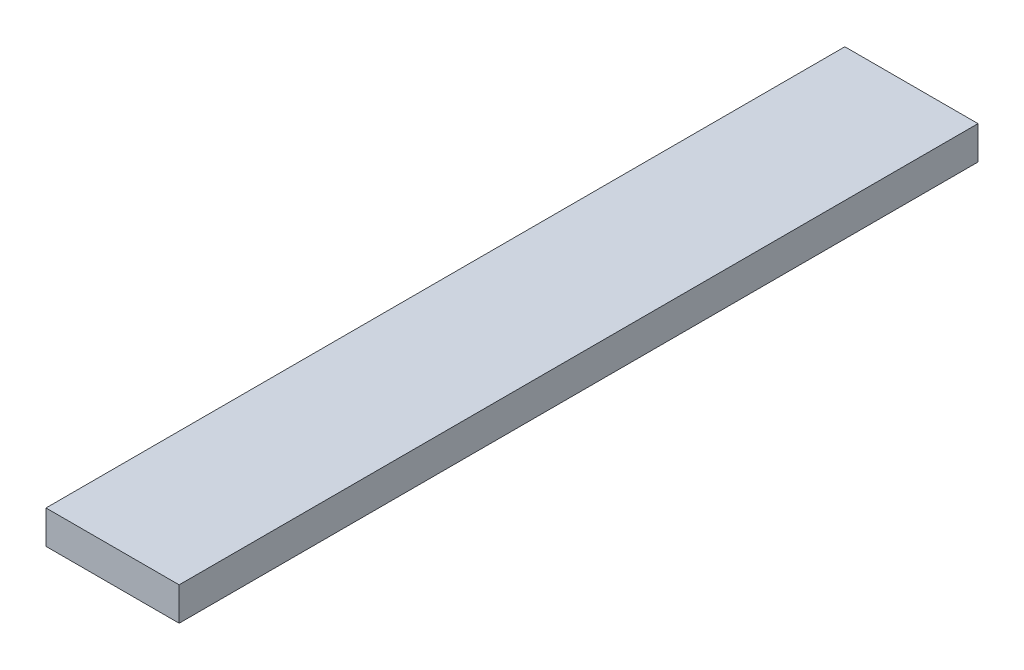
ISO-10303-21;
HEADER;
FILE_DESCRIPTION(('STEP AP214'),'2;1');
FILE_NAME('part.step','',(''),(''),'','','');
FILE_SCHEMA(('AUTOMOTIVE_DESIGN { 1 0 10303 214 1 1 1 1 }'));
ENDSEC;
DATA;
#1=APPLICATION_CONTEXT('core data for automotive mechanical design processes');
#2=APPLICATION_PROTOCOL_DEFINITION('international standard','automotive_design',2000,#1);
#3=PRODUCT_CONTEXT('',#1,'mechanical');
#4=PRODUCT('Part','Part','',(#3));
#5=PRODUCT_RELATED_PRODUCT_CATEGORY('part','',(#4));
#6=PRODUCT_DEFINITION_FORMATION('','',#4);
#7=PRODUCT_DEFINITION_CONTEXT('part definition',#1,'design');
#8=PRODUCT_DEFINITION('design','',#6,#7);
#9=PRODUCT_DEFINITION_SHAPE('','',#8);
#10=(LENGTH_UNIT() NAMED_UNIT(*) SI_UNIT(.MILLI.,.METRE.));
#11=(NAMED_UNIT(*) PLANE_ANGLE_UNIT() SI_UNIT($,.RADIAN.));
#12=(NAMED_UNIT(*) SI_UNIT($,.STERADIAN.) SOLID_ANGLE_UNIT());
#13=UNCERTAINTY_MEASURE_WITH_UNIT(LENGTH_MEASURE(1.E-05),#10,'distance_accuracy_value','');
#14=(GEOMETRIC_REPRESENTATION_CONTEXT(3) GLOBAL_UNCERTAINTY_ASSIGNED_CONTEXT((#13)) GLOBAL_UNIT_ASSIGNED_CONTEXT((#10,
#11,#12)) REPRESENTATION_CONTEXT('',''));
#15=CARTESIAN_POINT('',(0.,0.,0.));
#16=DIRECTION('',(0.,0.,1.));
#17=DIRECTION('',(1.,0.,0.));
#18=AXIS2_PLACEMENT_3D('',#15,#16,#17);
#19=CARTESIAN_POINT('',(1.32949207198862E-11,3.88578058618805E-13,120.000000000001));
#20=DIRECTION('',(1.,0.,0.));
#21=DIRECTION('',(0.,0.,-1.));
#22=AXIS2_PLACEMENT_3D('',#19,#20,#21);
#23=PLANE('',#22);
#24=DIRECTION('',(0.,-1.,0.));
#25=VECTOR('',#24,1.);
#26=CARTESIAN_POINT('',(0.,0.,0.));
#27=LINE('',#26,#25);
#28=CARTESIAN_POINT('',(-4.44089209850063E-13,5.00000000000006,-3.33066907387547E-13));
#29=VERTEX_POINT('',#28);
#30=CARTESIAN_POINT('',(0.,0.,0.));
#31=VERTEX_POINT('',#30);
#32=EDGE_CURVE('E81',#29,#31,#27,.T.);
#33=ORIENTED_EDGE('',*,*,#32,.T.);
#34=DIRECTION('',(0.,0.,-1.));
#35=VECTOR('',#34,1.);
#36=CARTESIAN_POINT('',(1.32949207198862E-11,3.88578058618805E-13,120.000000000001));
#37=LINE('',#36,#35);
#38=CARTESIAN_POINT('',(1.32949207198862E-11,3.88578058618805E-13,120.000000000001));
#39=VERTEX_POINT('',#38);
#40=EDGE_CURVE('E11',#39,#31,#37,.T.);
#41=ORIENTED_EDGE('',*,*,#40,.F.);
#42=DIRECTION('',(0.,-1.,0.));
#43=VECTOR('',#42,1.);
#44=CARTESIAN_POINT('',(1.32949207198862E-11,3.88578058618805E-13,120.000000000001));
#45=LINE('',#44,#43);
#46=CARTESIAN_POINT('',(1.30728761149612E-11,5.00000000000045,120.000000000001));
#47=VERTEX_POINT('',#46);
#48=EDGE_CURVE('E104',#47,#39,#45,.T.);
#49=ORIENTED_EDGE('',*,*,#48,.F.);
#50=DIRECTION('',(0.,0.,-1.));
#51=VECTOR('',#50,1.);
#52=CARTESIAN_POINT('',(1.30728761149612E-11,5.00000000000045,120.000000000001));
#53=LINE('',#52,#51);
#54=EDGE_CURVE('E94',#47,#29,#53,.T.);
#55=ORIENTED_EDGE('',*,*,#54,.T.);
#56=EDGE_LOOP('',(#33,#41,#49,#55));
#57=FACE_BOUND('',#56,.T.);
#58=ADVANCED_FACE('F36',(#57),#23,.F.);
#59=CARTESIAN_POINT('',(1.32949207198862E-11,3.88578058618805E-13,120.000000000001));
#60=DIRECTION('',(0.,1.,0.));
#61=DIRECTION('',(0.,0.,1.));
#62=AXIS2_PLACEMENT_3D('',#59,#60,#61);
#63=PLANE('',#62);
#64=DIRECTION('',(1.,0.,0.));
#65=VECTOR('',#64,1.);
#66=CARTESIAN_POINT('',(0.,0.,0.));
#67=LINE('',#66,#65);
#68=CARTESIAN_POINT('',(20.,-7.7715611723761E-13,1.11022302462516E-13));
#69=VERTEX_POINT('',#68);
#70=EDGE_CURVE('E77',#31,#69,#67,.T.);
#71=ORIENTED_EDGE('',*,*,#70,.T.);
#72=DIRECTION('',(0.,0.,-1.));
#73=VECTOR('',#72,1.);
#74=CARTESIAN_POINT('',(20.0000000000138,-3.88578058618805E-13,120.));
#75=LINE('',#74,#73);
#76=CARTESIAN_POINT('',(20.0000000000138,-3.88578058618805E-13,120.));
#77=VERTEX_POINT('',#76);
#78=EDGE_CURVE('E44',#77,#69,#75,.T.);
#79=ORIENTED_EDGE('',*,*,#78,.F.);
#80=DIRECTION('',(1.,0.,0.));
#81=VECTOR('',#80,1.);
#82=CARTESIAN_POINT('',(1.32949207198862E-11,3.88578058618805E-13,120.000000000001));
#83=LINE('',#82,#81);
#84=EDGE_CURVE('E90',#39,#77,#83,.T.);
#85=ORIENTED_EDGE('',*,*,#84,.F.);
#86=ORIENTED_EDGE('',*,*,#40,.T.);
#87=EDGE_LOOP('',(#71,#79,#85,#86));
#88=FACE_BOUND('',#87,.T.);
#89=ADVANCED_FACE('F89',(#88),#63,.F.);
#90=CARTESIAN_POINT('',(20.0000000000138,-3.88578058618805E-13,120.));
#91=DIRECTION('',(-1.,0.,0.));
#92=DIRECTION('',(0.,0.,1.));
#93=AXIS2_PLACEMENT_3D('',#90,#91,#92);
#94=PLANE('',#93);
#95=DIRECTION('',(0.,1.,0.));
#96=VECTOR('',#95,1.);
#97=CARTESIAN_POINT('',(20.,-7.7715611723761E-13,1.11022302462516E-13));
#98=LINE('',#97,#96);
#99=CARTESIAN_POINT('',(20.0000000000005,4.99999999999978,0.));
#100=VERTEX_POINT('',#99);
#101=EDGE_CURVE('E82',#69,#100,#98,.T.);
#102=ORIENTED_EDGE('',*,*,#101,.T.);
#103=DIRECTION('',(0.,0.,-1.));
#104=VECTOR('',#103,1.);
#105=CARTESIAN_POINT('',(20.0000000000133,5.00000000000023,120.));
#106=LINE('',#105,#104);
#107=CARTESIAN_POINT('',(20.0000000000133,5.00000000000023,120.));
#108=VERTEX_POINT('',#107);
#109=EDGE_CURVE('E114',#108,#100,#106,.T.);
#110=ORIENTED_EDGE('',*,*,#109,.F.);
#111=DIRECTION('',(0.,1.,0.));
#112=VECTOR('',#111,1.);
#113=CARTESIAN_POINT('',(20.0000000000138,-3.88578058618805E-13,120.));
#114=LINE('',#113,#112);
#115=EDGE_CURVE('E56',#77,#108,#114,.T.);
#116=ORIENTED_EDGE('',*,*,#115,.F.);
#117=ORIENTED_EDGE('',*,*,#78,.T.);
#118=EDGE_LOOP('',(#102,#110,#116,#117));
#119=FACE_BOUND('',#118,.T.);
#120=ADVANCED_FACE('F119',(#119),#94,.F.);
#121=CARTESIAN_POINT('',(1.30728761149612E-11,5.00000000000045,120.000000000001));
#122=DIRECTION('',(0.,-1.,0.));
#123=DIRECTION('',(0.,0.,-1.));
#124=AXIS2_PLACEMENT_3D('',#121,#122,#123);
#125=PLANE('',#124);
#126=DIRECTION('',(-1.,0.,0.));
#127=VECTOR('',#126,1.);
#128=CARTESIAN_POINT('',(-4.44089209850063E-13,5.00000000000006,-3.33066907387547E-13));
#129=LINE('',#128,#127);
#130=EDGE_CURVE('E101',#100,#29,#129,.T.);
#131=ORIENTED_EDGE('',*,*,#130,.T.);
#132=ORIENTED_EDGE('',*,*,#54,.F.);
#133=DIRECTION('',(-1.,0.,0.));
#134=VECTOR('',#133,1.);
#135=CARTESIAN_POINT('',(1.30728761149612E-11,5.00000000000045,120.000000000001));
#136=LINE('',#135,#134);
#137=EDGE_CURVE('E51',#108,#47,#136,.T.);
#138=ORIENTED_EDGE('',*,*,#137,.F.);
#139=ORIENTED_EDGE('',*,*,#109,.T.);
#140=EDGE_LOOP('',(#131,#132,#138,#139));
#141=FACE_BOUND('',#140,.T.);
#142=ADVANCED_FACE('F121',(#141),#125,.F.);
#143=CARTESIAN_POINT('',(1.30728761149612E-11,5.00000000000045,120.000000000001));
#144=DIRECTION('',(0.,0.,-1.));
#145=DIRECTION('',(-1.,0.,0.));
#146=AXIS2_PLACEMENT_3D('',#143,#144,#145);
#147=PLANE('',#146);
#148=ORIENTED_EDGE('',*,*,#48,.T.);
#149=ORIENTED_EDGE('',*,*,#84,.T.);
#150=ORIENTED_EDGE('',*,*,#115,.T.);
#151=ORIENTED_EDGE('',*,*,#137,.T.);
#152=EDGE_LOOP('',(#148,#149,#150,#151));
#153=FACE_BOUND('',#152,.T.);
#154=ADVANCED_FACE('F122',(#153),#147,.F.);
#155=CARTESIAN_POINT('',(-4.44089209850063E-13,5.00000000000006,-3.33066907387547E-13));
#156=DIRECTION('',(0.,0.,-1.));
#157=DIRECTION('',(-1.,0.,0.));
#158=AXIS2_PLACEMENT_3D('',#155,#156,#157);
#159=PLANE('',#158);
#160=ORIENTED_EDGE('',*,*,#32,.F.);
#161=ORIENTED_EDGE('',*,*,#130,.F.);
#162=ORIENTED_EDGE('',*,*,#101,.F.);
#163=ORIENTED_EDGE('',*,*,#70,.F.);
#164=EDGE_LOOP('',(#160,#161,#162,#163));
#165=FACE_BOUND('',#164,.T.);
#166=ADVANCED_FACE('F78',(#165),#159,.T.);
#167=CLOSED_SHELL('',(#58,#89,#120,#142,#154,#166));
#168=MANIFOLD_SOLID_BREP('B2',#167);
#169=ADVANCED_BREP_SHAPE_REPRESENTATION('',(#18,#168),#14);
#170=SHAPE_DEFINITION_REPRESENTATION(#9,#169);
ENDSEC;
END-ISO-10303-21;
